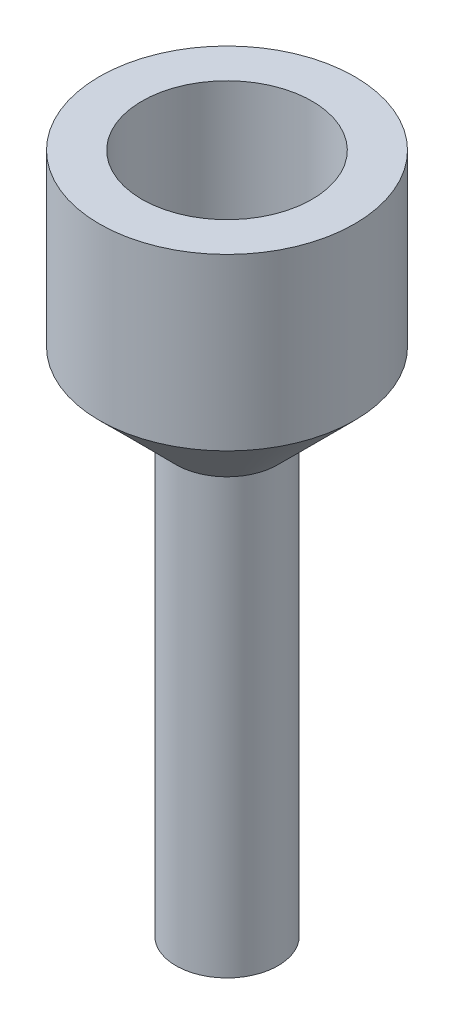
ISO-10303-21;
HEADER;
FILE_DESCRIPTION(('STEP AP214'),'2;1');
FILE_NAME('part.step','',(''),(''),'','','');
FILE_SCHEMA(('AUTOMOTIVE_DESIGN { 1 0 10303 214 1 1 1 1 }'));
ENDSEC;
DATA;
#1=APPLICATION_CONTEXT('core data for automotive mechanical design processes');
#2=APPLICATION_PROTOCOL_DEFINITION('international standard','automotive_design',2000,#1);
#3=PRODUCT_CONTEXT('',#1,'mechanical');
#4=PRODUCT('Part','Part','',(#3));
#5=PRODUCT_RELATED_PRODUCT_CATEGORY('part','',(#4));
#6=PRODUCT_DEFINITION_FORMATION('','',#4);
#7=PRODUCT_DEFINITION_CONTEXT('part definition',#1,'design');
#8=PRODUCT_DEFINITION('design','',#6,#7);
#9=PRODUCT_DEFINITION_SHAPE('','',#8);
#10=(LENGTH_UNIT() NAMED_UNIT(*) SI_UNIT(.MILLI.,.METRE.));
#11=(NAMED_UNIT(*) PLANE_ANGLE_UNIT() SI_UNIT($,.RADIAN.));
#12=(NAMED_UNIT(*) SI_UNIT($,.STERADIAN.) SOLID_ANGLE_UNIT());
#13=UNCERTAINTY_MEASURE_WITH_UNIT(LENGTH_MEASURE(1.E-05),#10,'distance_accuracy_value','');
#14=(GEOMETRIC_REPRESENTATION_CONTEXT(3) GLOBAL_UNCERTAINTY_ASSIGNED_CONTEXT((#13)) GLOBAL_UNIT_ASSIGNED_CONTEXT((#10,
#11,#12)) REPRESENTATION_CONTEXT('',''));
#15=CARTESIAN_POINT('',(0.,0.,0.));
#16=DIRECTION('',(0.,0.,1.));
#17=DIRECTION('',(1.,0.,0.));
#18=AXIS2_PLACEMENT_3D('',#15,#16,#17);
#19=CARTESIAN_POINT('',(0.,0.,0.));
#20=DIRECTION('',(0.,1.,0.));
#21=DIRECTION('',(-1.,0.,0.));
#22=AXIS2_PLACEMENT_3D('',#19,#20,#21);
#23=PLANE('',#22);
#24=CARTESIAN_POINT('',(0.,0.,0.));
#25=DIRECTION('',(0.,-1.,0.));
#26=DIRECTION('',(0.,0.,-1.));
#27=AXIS2_PLACEMENT_3D('',#24,#25,#26);
#28=CIRCLE('',#27,2.49999999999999);
#29=CARTESIAN_POINT('',(0.,0.,-2.49999999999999));
#30=VERTEX_POINT('',#29);
#31=EDGE_CURVE('E56',#30,#30,#28,.T.);
#32=ORIENTED_EDGE('',*,*,#31,.F.);
#33=EDGE_LOOP('',(#32));
#34=FACE_BOUND('',#33,.T.);
#35=CARTESIAN_POINT('',(0.,0.,0.));
#36=DIRECTION('',(0.,1.,0.));
#37=DIRECTION('',(-1.,0.,0.));
#38=AXIS2_PLACEMENT_3D('',#35,#36,#37);
#39=CIRCLE('',#38,6.);
#40=CARTESIAN_POINT('',(-6.,0.,0.));
#41=VERTEX_POINT('',#40);
#42=EDGE_CURVE('E11',#41,#41,#39,.T.);
#43=ORIENTED_EDGE('',*,*,#42,.F.);
#44=EDGE_LOOP('',(#43));
#45=FACE_BOUND('',#44,.T.);
#46=ADVANCED_FACE('F34',(#34,#45),#23,.F.);
#47=CARTESIAN_POINT('',(0.,80.,0.));
#48=DIRECTION('',(0.,1.,0.));
#49=DIRECTION('',(-1.,0.,0.));
#50=AXIS2_PLACEMENT_3D('',#47,#48,#49);
#51=CYLINDRICAL_SURFACE('',#50,6.);
#52=CARTESIAN_POINT('',(0.,51.,0.));
#53=DIRECTION('',(0.,1.,0.));
#54=DIRECTION('',(-1.,0.,0.));
#55=AXIS2_PLACEMENT_3D('',#52,#53,#54);
#56=CIRCLE('',#55,6.);
#57=CARTESIAN_POINT('',(-6.,51.,0.));
#58=VERTEX_POINT('',#57);
#59=EDGE_CURVE('E41',#58,#58,#56,.T.);
#60=ORIENTED_EDGE('',*,*,#59,.F.);
#61=EDGE_LOOP('',(#60));
#62=FACE_BOUND('',#61,.T.);
#63=ORIENTED_EDGE('',*,*,#42,.T.);
#64=EDGE_LOOP('',(#63));
#65=FACE_BOUND('',#64,.T.);
#66=ADVANCED_FACE('F77',(#62,#65),#51,.T.);
#67=CARTESIAN_POINT('',(0.,51.,0.));
#68=DIRECTION('',(0.,1.,0.));
#69=DIRECTION('',(-1.,0.,0.));
#70=AXIS2_PLACEMENT_3D('',#67,#68,#69);
#71=CONICAL_SURFACE('',#70,6.,0.785398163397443);
#72=CARTESIAN_POINT('',(0.,60.0000000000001,0.));
#73=DIRECTION('',(0.,1.,0.));
#74=DIRECTION('',(-1.,0.,0.));
#75=AXIS2_PLACEMENT_3D('',#72,#73,#74);
#76=CIRCLE('',#75,15.);
#77=CARTESIAN_POINT('',(-15.,60.0000000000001,0.));
#78=VERTEX_POINT('',#77);
#79=EDGE_CURVE('E70',#78,#78,#76,.T.);
#80=ORIENTED_EDGE('',*,*,#79,.F.);
#81=EDGE_LOOP('',(#80));
#82=FACE_BOUND('',#81,.T.);
#83=ORIENTED_EDGE('',*,*,#59,.T.);
#84=EDGE_LOOP('',(#83));
#85=FACE_BOUND('',#84,.T.);
#86=ADVANCED_FACE('F75',(#82,#85),#71,.T.);
#87=CARTESIAN_POINT('',(0.,80.,0.));
#88=DIRECTION('',(0.,1.,0.));
#89=DIRECTION('',(-1.,0.,0.));
#90=AXIS2_PLACEMENT_3D('',#87,#88,#89);
#91=CYLINDRICAL_SURFACE('',#90,15.);
#92=CARTESIAN_POINT('',(0.,80.,0.));
#93=DIRECTION('',(0.,1.,0.));
#94=DIRECTION('',(-1.,0.,0.));
#95=AXIS2_PLACEMENT_3D('',#92,#93,#94);
#96=CIRCLE('',#95,15.);
#97=CARTESIAN_POINT('',(-15.,80.,0.));
#98=VERTEX_POINT('',#97);
#99=EDGE_CURVE('E67',#98,#98,#96,.T.);
#100=ORIENTED_EDGE('',*,*,#99,.F.);
#101=EDGE_LOOP('',(#100));
#102=FACE_BOUND('',#101,.T.);
#103=ORIENTED_EDGE('',*,*,#79,.T.);
#104=EDGE_LOOP('',(#103));
#105=FACE_BOUND('',#104,.T.);
#106=ADVANCED_FACE('F103',(#102,#105),#91,.T.);
#107=CARTESIAN_POINT('',(15.,80.,0.));
#108=DIRECTION('',(0.,-1.,0.));
#109=DIRECTION('',(1.,0.,0.));
#110=AXIS2_PLACEMENT_3D('',#107,#108,#109);
#111=PLANE('',#110);
#112=CARTESIAN_POINT('',(0.,80.,0.));
#113=DIRECTION('',(0.,1.,0.));
#114=DIRECTION('',(0.,0.,1.));
#115=AXIS2_PLACEMENT_3D('',#112,#113,#114);
#116=CIRCLE('',#115,10.);
#117=CARTESIAN_POINT('',(0.,80.,10.));
#118=VERTEX_POINT('',#117);
#119=EDGE_CURVE('E59',#118,#118,#116,.T.);
#120=ORIENTED_EDGE('',*,*,#119,.F.);
#121=EDGE_LOOP('',(#120));
#122=FACE_BOUND('',#121,.T.);
#123=ORIENTED_EDGE('',*,*,#99,.T.);
#124=EDGE_LOOP('',(#123));
#125=FACE_BOUND('',#124,.T.);
#126=ADVANCED_FACE('F100',(#122,#125),#111,.F.);
#127=CARTESIAN_POINT('',(0.,65.,0.));
#128=DIRECTION('',(0.,1.,0.));
#129=DIRECTION('',(0.,0.,1.));
#130=AXIS2_PLACEMENT_3D('',#127,#128,#129);
#131=CONICAL_SURFACE('',#130,10.,1.02974425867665);
#132=CARTESIAN_POINT('',(0.,58.9913938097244,0.));
#133=VERTEX_POINT('',#132);
#134=VERTEX_LOOP('',#133);
#135=FACE_BOUND('',#134,.T.);
#136=CARTESIAN_POINT('',(0.,65.,0.));
#137=DIRECTION('',(0.,1.,0.));
#138=DIRECTION('',(0.,0.,1.));
#139=AXIS2_PLACEMENT_3D('',#136,#137,#138);
#140=CIRCLE('',#139,10.);
#141=CARTESIAN_POINT('',(0.,65.,10.));
#142=VERTEX_POINT('',#141);
#143=EDGE_CURVE('E64',#142,#142,#140,.T.);
#144=ORIENTED_EDGE('',*,*,#143,.T.);
#145=EDGE_LOOP('',(#144));
#146=FACE_BOUND('',#145,.T.);
#147=ADVANCED_FACE('F94',(#135,#146),#131,.F.);
#148=CARTESIAN_POINT('',(0.,80.,0.));
#149=DIRECTION('',(0.,1.,0.));
#150=DIRECTION('',(0.,0.,1.));
#151=AXIS2_PLACEMENT_3D('',#148,#149,#150);
#152=CYLINDRICAL_SURFACE('',#151,10.);
#153=ORIENTED_EDGE('',*,*,#143,.F.);
#154=EDGE_LOOP('',(#153));
#155=FACE_BOUND('',#154,.T.);
#156=ORIENTED_EDGE('',*,*,#119,.T.);
#157=EDGE_LOOP('',(#156));
#158=FACE_BOUND('',#157,.T.);
#159=ADVANCED_FACE('F89',(#155,#158),#152,.F.);
#160=CARTESIAN_POINT('',(0.,0.,0.));
#161=DIRECTION('',(0.,-1.,0.));
#162=DIRECTION('',(0.,0.,-1.));
#163=AXIS2_PLACEMENT_3D('',#160,#161,#162);
#164=CYLINDRICAL_SURFACE('',#163,2.49999999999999);
#165=CARTESIAN_POINT('',(0.,15.,0.));
#166=DIRECTION('',(0.,-1.,0.));
#167=DIRECTION('',(0.,0.,-1.));
#168=AXIS2_PLACEMENT_3D('',#165,#166,#167);
#169=CIRCLE('',#168,2.5);
#170=CARTESIAN_POINT('',(0.,15.,-2.5));
#171=VERTEX_POINT('',#170);
#172=EDGE_CURVE('E54',#171,#171,#169,.T.);
#173=ORIENTED_EDGE('',*,*,#172,.F.);
#174=EDGE_LOOP('',(#173));
#175=FACE_BOUND('',#174,.T.);
#176=ORIENTED_EDGE('',*,*,#31,.T.);
#177=EDGE_LOOP('',(#176));
#178=FACE_BOUND('',#177,.T.);
#179=ADVANCED_FACE('F50',(#175,#178),#164,.F.);
#180=CARTESIAN_POINT('',(0.,15.,0.));
#181=DIRECTION('',(0.,-1.,0.));
#182=DIRECTION('',(0.,0.,-1.));
#183=AXIS2_PLACEMENT_3D('',#180,#181,#182);
#184=CONICAL_SURFACE('',#183,2.5,1.02974425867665);
#185=CARTESIAN_POINT('',(0.,16.5021515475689,0.));
#186=VERTEX_POINT('',#185);
#187=VERTEX_LOOP('',#186);
#188=FACE_BOUND('',#187,.T.);
#189=ORIENTED_EDGE('',*,*,#172,.T.);
#190=EDGE_LOOP('',(#189));
#191=FACE_BOUND('',#190,.T.);
#192=ADVANCED_FACE('F47',(#188,#191),#184,.F.);
#193=CLOSED_SHELL('',(#46,#66,#86,#106,#126,#147,#159,#179,#192));
#194=MANIFOLD_SOLID_BREP('B2',#193);
#195=ADVANCED_BREP_SHAPE_REPRESENTATION('',(#18,#194),#14);
#196=SHAPE_DEFINITION_REPRESENTATION(#9,#195);
ENDSEC;
END-ISO-10303-21;
